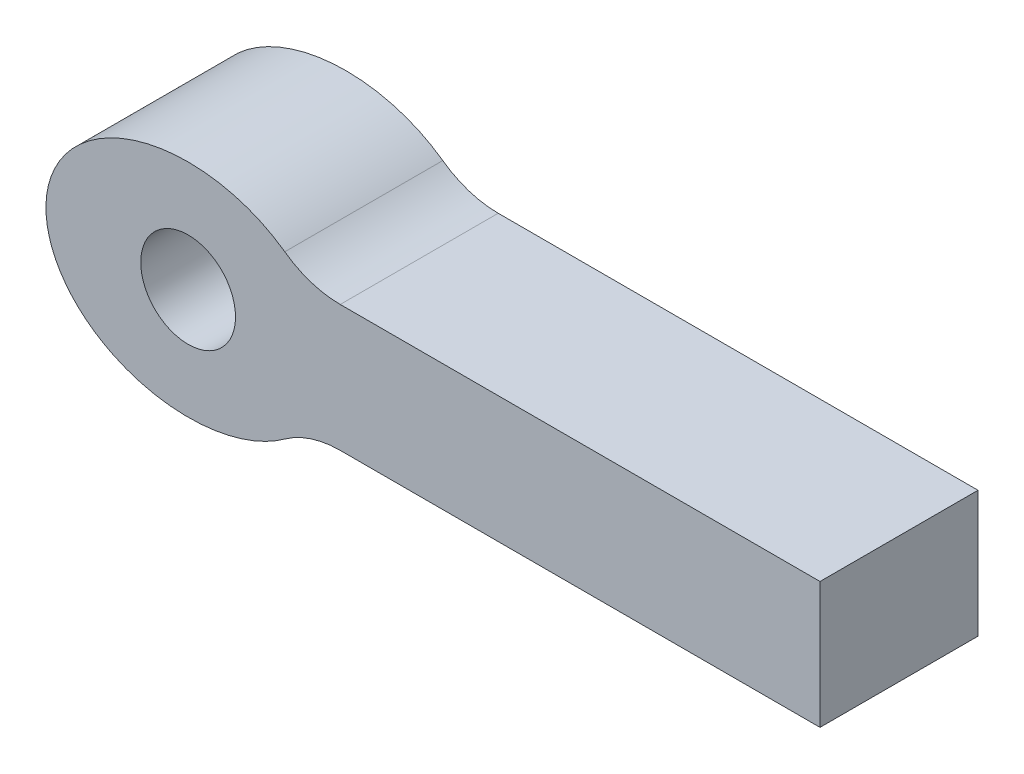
from build123d import *

# Parameters (mm, degrees)
SZKIC1_R                    = 1.5
DODANIE_WYCI_GNI_CIE1_DEPTH = 2.5


with BuildPart() as part:
    # Szkic1 → Dodanie-wyci_gni_cie1 (new, symmetric)
    with BuildSketch(Plane.XY):
        with BuildLine():
            Line((4.814088, 2), (20, 2))
            Line((20, 2), (20, -2))
            Line((20, -2), (4.814088, -2))
            ThreePointArc((4.814088, -2), (3.892148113, -2.145174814), (3.059436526, -2.566648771))
            add(Edge.make_bspline(
                [(3.059436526, 2.566648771), (-4.5, 8.017640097), (-4.5, 0), (-4.5, -8.017640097), (3.059436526, -2.566648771)],
                knots=[0.823204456, 0.823204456, 0.823204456, 3.141592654, 3.141592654, 5.459980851, 5.459980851, 5.459980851], degree=2, weights=[1, 0.400078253, 1, 0.400078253, 1]))
            ThreePointArc((3.059436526, 2.566648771), (3.892148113, 2.145174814), (4.814088, 2))
        make_face()
        Circle(SZKIC1_R, mode=Mode.SUBTRACT)
    extrude(amount=DODANIE_WYCI_GNI_CIE1_DEPTH, both=True)


solid = part.part
